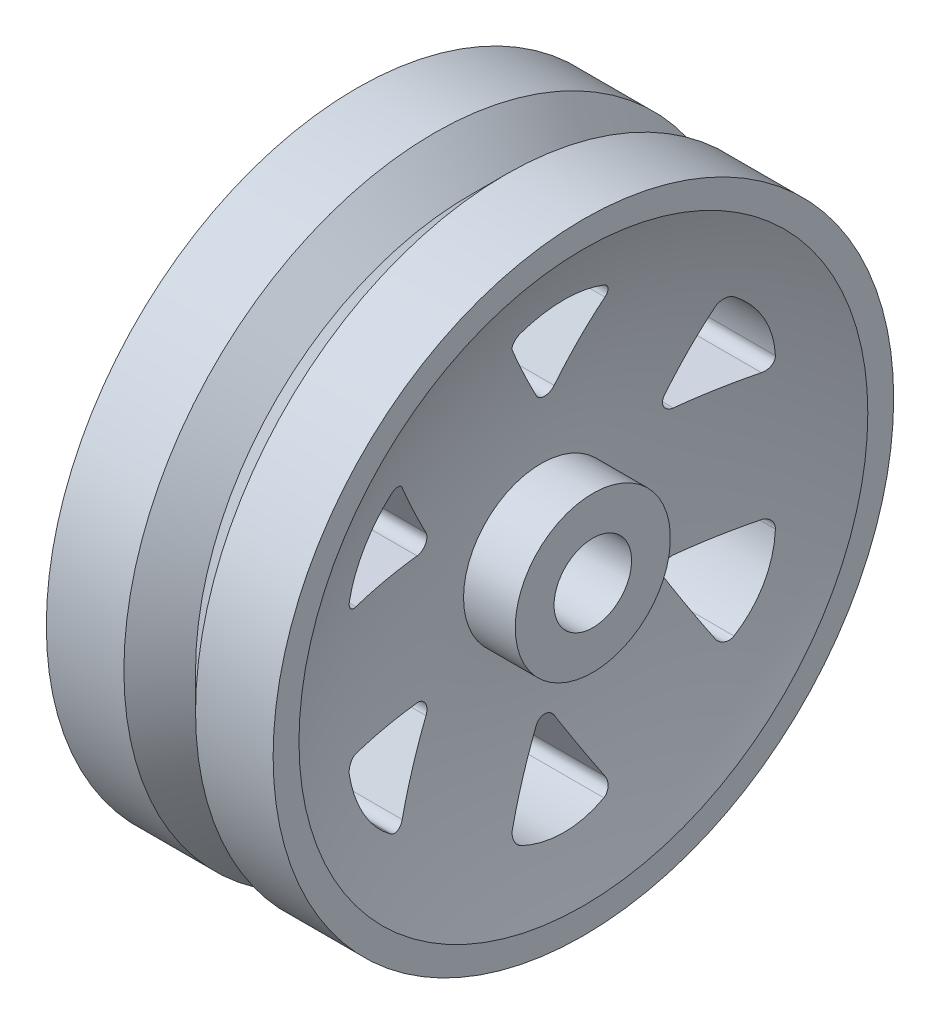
from build123d import *

# Parameters (mm, degrees)
CUT_EXTRUDE1_DEPTH = 123.385577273


with BuildPart() as part:
    # Sketch1 → Revolve1 (revolve)
    with BuildSketch(Plane.XY, mode=Mode.PRIVATE) as revolve1_sk:
        with BuildLine():
            Line((0, 9.525), (0, 19.05))
            Line((0, 19.05), (12.7, 19.05))
            ThreePointArc((12.7, 19.05), (10.076756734, 44.975480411), (2.313367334, 69.85))
            Line((2.313367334, 69.85), (2.313367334, 76.2))
            Line((2.313367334, 76.2), (21.363367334, 76.2))
            Line((21.363367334, 76.2), (30.1625, 67.400867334))
            Line((30.1625, 67.400867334), (38.961632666, 76.2))
            Line((38.961632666, 76.2), (58.011632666, 76.2))
            Line((58.011632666, 76.2), (58.011632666, 69.85))
            ThreePointArc((58.011632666, 69.85), (50.248243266, 44.975480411), (47.625, 19.05))
            Line((47.625, 19.05), (60.325, 19.05))
            Line((60.325, 19.05), (60.325, 9.525))
            Line((60.325, 9.525), (0, 9.525))
        make_face()
    revolve(revolve1_sk.sketch.rotate(Axis((0, 0, 0), (1, 0, 0)), 90), axis=Axis((0, 0, 0), (1, 0, 0)))

    # Sketch2 → Cut-Extrude1 (cut, through all)
    with BuildSketch(Plane(origin=(58.011632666, 0, 0), x_dir=(0, 0, -1), z_dir=(1, 0, 0))):
        with BuildLine():
            Line((2.199704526, 35.065906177), (11.359225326, 50.930661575))
            ThreePointArc((11.359225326, 50.930661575), (11.572592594, 52.993557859), (10.177245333, 54.52785662))
            ThreePointArc((10.177245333, 54.52785662), (0, 56.655906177), (-10.177245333, 54.52785662))
            ThreePointArc((-10.177245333, 54.52785662), (-11.572592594, 52.993557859), (-11.359225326, 50.930661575))
            Line((-11.359225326, 50.930661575), (-2.199704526, 35.065906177))
            ThreePointArc((-2.199704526, 35.065906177), (0, 33.795906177), (2.199704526, 35.065906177))
        make_face()
        with BuildLine():
            Line((31.467817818, 15.627953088), (49.786859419, 15.627953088))
            ThreePointArc((49.786859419, 15.627953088), (51.68006364, 16.474619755), (52.311131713, 18.450175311))
            ThreePointArc((52.311131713, 18.450175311), (49.065454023, 28.327953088), (42.13388638, 36.077681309))
            ThreePointArc((42.13388638, 36.077681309), (40.107471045, 36.518938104), (38.427634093, 35.302708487))
            Line((38.427634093, 35.302708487), (29.268113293, 19.437953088))
            ThreePointArc((29.268113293, 19.437953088), (29.268113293, 16.897953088), (31.467817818, 15.627953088))
        make_face()
        with BuildLine():
            Line((29.268113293, -19.437953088), (38.427634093, -35.302708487))
            ThreePointArc((38.427634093, -35.302708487), (40.107471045, -36.518938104), (42.13388638, -36.077681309))
            ThreePointArc((42.13388638, -36.077681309), (49.065454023, -28.327953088), (52.311131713, -18.450175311))
            ThreePointArc((52.311131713, -18.450175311), (51.68006364, -16.474619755), (49.786859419, -15.627953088))
            Line((49.786859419, -15.627953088), (31.467817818, -15.627953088))
            ThreePointArc((31.467817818, -15.627953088), (29.268113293, -16.897953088), (29.268113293, -19.437953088))
        make_face()
        with BuildLine():
            Line((-2.199704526, -35.065906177), (-11.359225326, -50.930661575))
            ThreePointArc((-11.359225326, -50.930661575), (-11.572592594, -52.993557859), (-10.177245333, -54.52785662))
            ThreePointArc((-10.177245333, -54.52785662), (0, -56.655906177), (10.177245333, -54.52785662))
            ThreePointArc((10.177245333, -54.52785662), (11.572592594, -52.993557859), (11.359225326, -50.930661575))
            Line((11.359225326, -50.930661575), (2.199704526, -35.065906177))
            ThreePointArc((2.199704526, -35.065906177), (0, -33.795906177), (-2.199704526, -35.065906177))
        make_face()
        with BuildLine():
            Line((-31.467817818, -15.627953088), (-49.786859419, -15.627953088))
            ThreePointArc((-49.786859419, -15.627953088), (-51.68006364, -16.474619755), (-52.311131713, -18.450175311))
            ThreePointArc((-52.311131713, -18.450175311), (-49.065454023, -28.327953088), (-42.13388638, -36.077681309))
            ThreePointArc((-42.13388638, -36.077681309), (-40.107471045, -36.518938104), (-38.427634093, -35.302708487))
            Line((-38.427634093, -35.302708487), (-29.268113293, -19.437953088))
            ThreePointArc((-29.268113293, -19.437953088), (-29.268113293, -16.897953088), (-31.467817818, -15.627953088))
        make_face()
        with BuildLine():
            Line((-29.268113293, 19.437953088), (-38.427634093, 35.302708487))
            ThreePointArc((-38.427634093, 35.302708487), (-40.107471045, 36.518938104), (-42.13388638, 36.077681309))
            ThreePointArc((-42.13388638, 36.077681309), (-49.065454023, 28.327953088), (-52.311131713, 18.450175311))
            ThreePointArc((-52.311131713, 18.450175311), (-51.68006364, 16.474619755), (-49.786859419, 15.627953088))
            Line((-49.786859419, 15.627953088), (-31.467817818, 15.627953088))
            ThreePointArc((-31.467817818, 15.627953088), (-29.268113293, 16.897953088), (-29.268113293, 19.437953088))
        make_face()
    extrude(amount=-CUT_EXTRUDE1_DEPTH, mode=Mode.SUBTRACT)


solid = part.part
